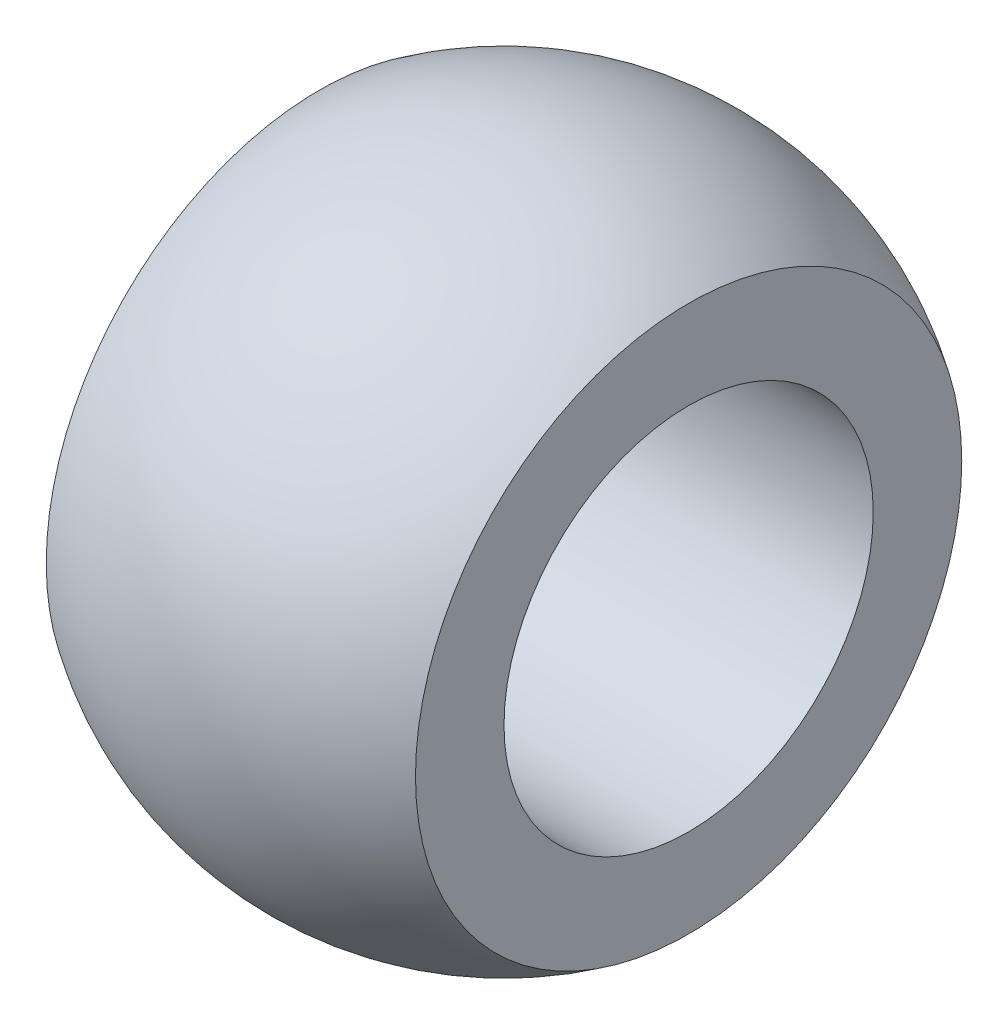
from build123d import *


with BuildPart() as part:
    # Esquisse2 → Base-R_volution (revolve)
    with BuildSketch(Plane.XY, mode=Mode.PRIVATE) as base_r_volution_sk:
        with BuildLine():
            Line((-7, 10.356157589), (-7, 7))
            Line((-7, 7), (7, 7))
            Line((7, 7), (7, 10.356157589))
            ThreePointArc((7, 10.356157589), (0, 12.5), (-7, 10.356157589))
        make_face()
    revolve(base_r_volution_sk.sketch.rotate(Axis((-20, 0, 0), (1, 0, 0)), 90), axis=Axis((-20, 0, 0), (1, 0, 0)))


solid = part.part
